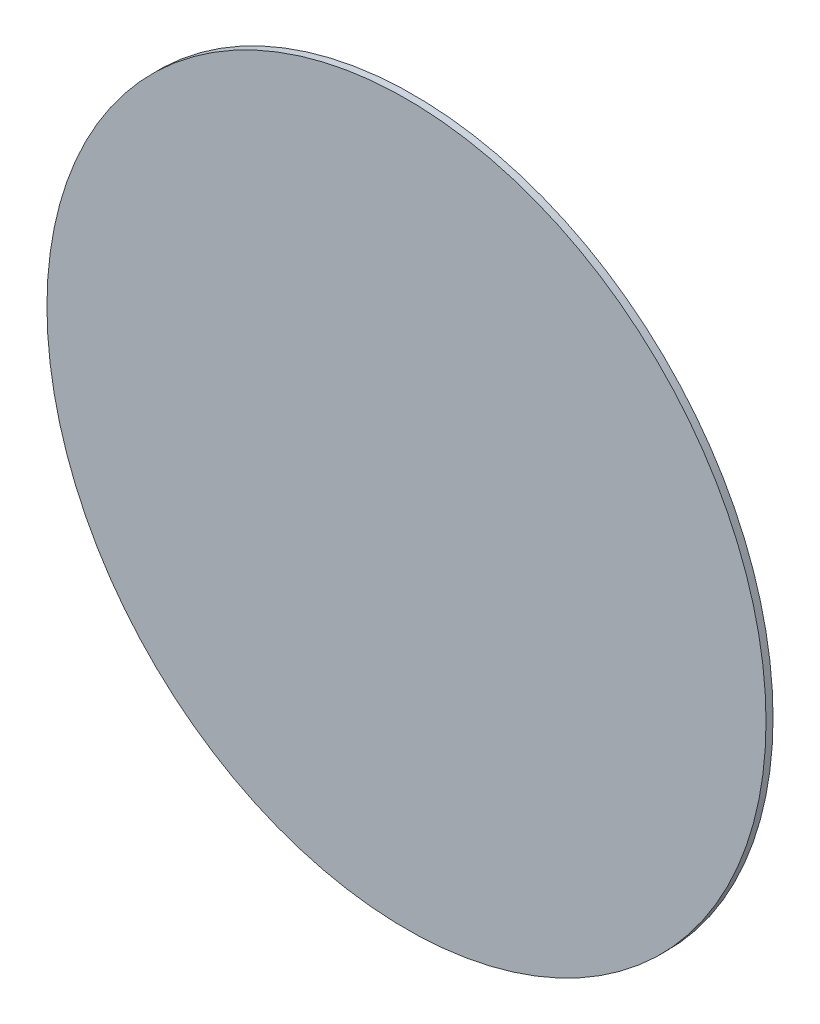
from build123d import *

# Parameters (mm, degrees)
SKETCH1_R      = 6.5
EXTRUDE1_DEPTH = 0.127


with BuildPart() as part:
    # Sketch1 → Extrude1 (new body)
    with BuildSketch(Plane.XY):
        with Locations(Location((0, 0, 0), (0, 0, 180))):
            Circle(SKETCH1_R)
    extrude(amount=EXTRUDE1_DEPTH)


solid = part.part
